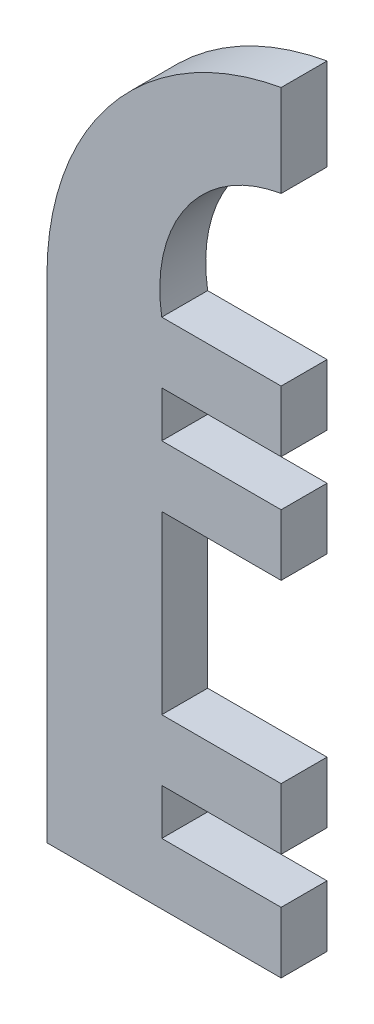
from build123d import *

# Parameters (mm, degrees)
BOSS_EXTRUDE1_DEPTH = 3


with BuildPart() as part:
    # Sketch1 → Boss-Extrude1 (new body)
    with BuildSketch(Plane.XY):
        with BuildLine():
            Line((0, 0), (0, 4))
            Line((0, 4), (-7.8, 4))
            Line((-7.8, 4), (-7.8, 7))
            Line((-7.8, 7), (0, 7))
            Line((0, 7), (0, 11))
            Line((0, 11), (-7.8, 11))
            Line((-7.8, 11), (-7.8, 22.5))
            Line((-7.8, 22.5), (0, 22.5))
            Line((0, 22.5), (0, 26.5))
            Line((0, 26.5), (-7.8, 26.5))
            Line((-7.8, 26.5), (-7.8, 29.5))
            Line((-7.8, 29.5), (0, 29.5))
            Line((0, 29.5), (0, 33.5))
            Line((0, 33.5), (-7.8, 33.5))
            ThreePointArc((-7.8, 33.5), (-6.156608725, 40.563368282), (0, 44.395870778))
            Line((0, 44.395870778), (0, 50.395870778))
            ThreePointArc((0, 50.395870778), (-10.969220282, 44.049769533), (-15.3, 32.14006166))
            Line((-15.3, 32.14006166), (-15.3, 0))
            Line((-15.3, 0), (0, 0))
        make_face()
    extrude(amount=BOSS_EXTRUDE1_DEPTH)


solid = part.part
